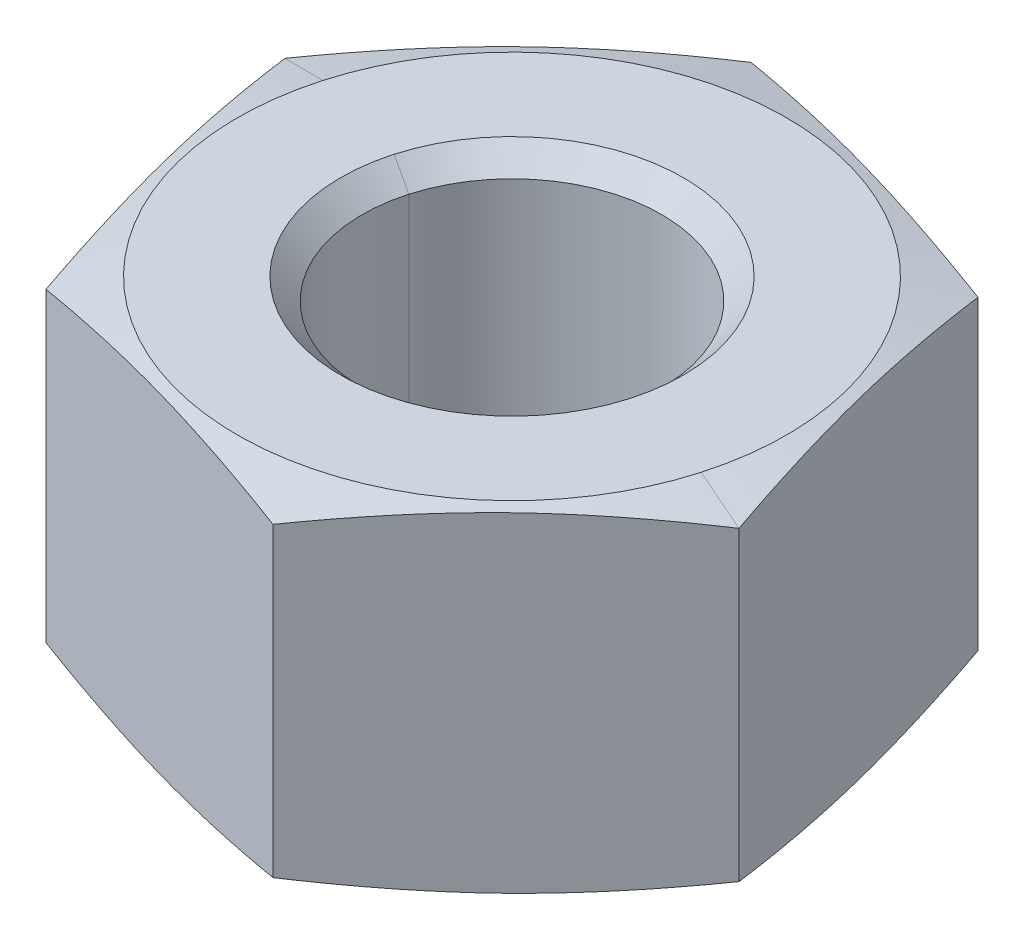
ISO-10303-21;
HEADER;
FILE_DESCRIPTION(('STEP AP214'),'2;1');
FILE_NAME('part.step','',(''),(''),'','','');
FILE_SCHEMA(('AUTOMOTIVE_DESIGN { 1 0 10303 214 1 1 1 1 }'));
ENDSEC;
DATA;
#1=APPLICATION_CONTEXT('core data for automotive mechanical design processes');
#2=APPLICATION_PROTOCOL_DEFINITION('international standard','automotive_design',2000,#1);
#3=PRODUCT_CONTEXT('',#1,'mechanical');
#4=PRODUCT('Part','Part','',(#3));
#5=PRODUCT_RELATED_PRODUCT_CATEGORY('part','',(#4));
#6=PRODUCT_DEFINITION_FORMATION('','',#4);
#7=PRODUCT_DEFINITION_CONTEXT('part definition',#1,'design');
#8=PRODUCT_DEFINITION('design','',#6,#7);
#9=PRODUCT_DEFINITION_SHAPE('','',#8);
#10=(LENGTH_UNIT() NAMED_UNIT(*) SI_UNIT(.MILLI.,.METRE.));
#11=(NAMED_UNIT(*) PLANE_ANGLE_UNIT() SI_UNIT($,.RADIAN.));
#12=(NAMED_UNIT(*) SI_UNIT($,.STERADIAN.) SOLID_ANGLE_UNIT());
#13=UNCERTAINTY_MEASURE_WITH_UNIT(LENGTH_MEASURE(1.E-05),#10,'distance_accuracy_value','');
#14=(GEOMETRIC_REPRESENTATION_CONTEXT(3) GLOBAL_UNCERTAINTY_ASSIGNED_CONTEXT((#13)) GLOBAL_UNIT_ASSIGNED_CONTEXT((#10,
#11,#12)) REPRESENTATION_CONTEXT('',''));
#15=CARTESIAN_POINT('',(0.,0.,0.));
#16=DIRECTION('',(0.,0.,1.));
#17=DIRECTION('',(1.,0.,0.));
#18=AXIS2_PLACEMENT_3D('',#15,#16,#17);
#19=CARTESIAN_POINT('',(-28.,-9.,8.5));
#20=DIRECTION('',(0.,-1.,0.));
#21=DIRECTION('',(-0.961969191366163,0.,-0.273157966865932));
#22=AXIS2_PLACEMENT_3D('',#19,#20,#21);
#23=CONICAL_SURFACE('',#22,2.4,0.785398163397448);
#24=DIRECTION('',(0.680214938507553,-0.707106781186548,0.193151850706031));
#25=VECTOR('',#24,1.);
#26=CARTESIAN_POINT('',(-25.6912739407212,-9.,9.15557912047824));
#27=LINE('',#26,#25);
#28=CARTESIAN_POINT('',(-25.979864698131,-8.7,9.07363173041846));
#29=VERTEX_POINT('',#28);
#30=CARTESIAN_POINT('',(-25.6912739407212,-9.,9.15557912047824));
#31=VERTEX_POINT('',#30);
#32=EDGE_CURVE('E164',#29,#31,#27,.T.);
#33=ORIENTED_EDGE('',*,*,#32,.F.);
#34=CARTESIAN_POINT('',(-28.,-8.7,8.5));
#35=DIRECTION('',(0.,-1.,0.));
#36=DIRECTION('',(-0.961969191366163,0.,-0.273157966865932));
#37=AXIS2_PLACEMENT_3D('',#34,#35,#36);
#38=CIRCLE('',#37,2.1);
#39=CARTESIAN_POINT('',(-30.020135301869,-8.7,7.92636826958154));
#40=VERTEX_POINT('',#39);
#41=EDGE_CURVE('E26',#40,#29,#38,.T.);
#42=ORIENTED_EDGE('',*,*,#41,.F.);
#43=DIRECTION('',(-0.680214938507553,-0.707106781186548,-0.193151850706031));
#44=VECTOR('',#43,1.);
#45=CARTESIAN_POINT('',(-30.3087260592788,-9.,7.84442087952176));
#46=LINE('',#45,#44);
#47=CARTESIAN_POINT('',(-30.3087260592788,-9.,7.84442087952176));
#48=VERTEX_POINT('',#47);
#49=EDGE_CURVE('E172',#40,#48,#46,.T.);
#50=ORIENTED_EDGE('',*,*,#49,.T.);
#51=CARTESIAN_POINT('',(-28.,-9.,8.5));
#52=DIRECTION('',(0.,1.,0.));
#53=DIRECTION('',(-0.961969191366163,0.,-0.273157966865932));
#54=AXIS2_PLACEMENT_3D('',#51,#52,#53);
#55=CIRCLE('',#54,2.4);
#56=EDGE_CURVE('E150',#31,#48,#55,.T.);
#57=ORIENTED_EDGE('',*,*,#56,.F.);
#58=EDGE_LOOP('',(#33,#42,#50,#57));
#59=FACE_BOUND('',#58,.T.);
#60=ADVANCED_FACE('F15',(#59),#23,.F.);
#61=CARTESIAN_POINT('',(-28.,-4.6,8.5));
#62=DIRECTION('',(0.,1.,0.));
#63=DIRECTION('',(0.961969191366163,0.,0.273157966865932));
#64=AXIS2_PLACEMENT_3D('',#61,#62,#63);
#65=CONICAL_SURFACE('',#64,2.1,0.78539816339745);
#66=DIRECTION('',(-0.680214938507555,0.707106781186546,-0.193151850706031));
#67=VECTOR('',#66,1.);
#68=CARTESIAN_POINT('',(-30.020135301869,-4.6,7.92636826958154));
#69=LINE('',#68,#67);
#70=CARTESIAN_POINT('',(-30.020135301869,-4.6,7.92636826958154));
#71=VERTEX_POINT('',#70);
#72=CARTESIAN_POINT('',(-30.3087260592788,-4.3,7.84442087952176));
#73=VERTEX_POINT('',#72);
#74=EDGE_CURVE('E183',#71,#73,#69,.T.);
#75=ORIENTED_EDGE('',*,*,#74,.F.);
#76=CARTESIAN_POINT('',(-28.,-4.6,8.5));
#77=DIRECTION('',(0.,1.,0.));
#78=DIRECTION('',(-0.961969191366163,0.,-0.273157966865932));
#79=AXIS2_PLACEMENT_3D('',#76,#77,#78);
#80=CIRCLE('',#79,2.1);
#81=CARTESIAN_POINT('',(-25.979864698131,-4.6,9.07363173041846));
#82=VERTEX_POINT('',#81);
#83=EDGE_CURVE('E10',#82,#71,#80,.T.);
#84=ORIENTED_EDGE('',*,*,#83,.F.);
#85=DIRECTION('',(0.680214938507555,0.707106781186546,0.193151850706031));
#86=VECTOR('',#85,1.);
#87=CARTESIAN_POINT('',(-25.979864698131,-4.6,9.07363173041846));
#88=LINE('',#87,#86);
#89=CARTESIAN_POINT('',(-25.6912739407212,-4.3,9.15557912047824));
#90=VERTEX_POINT('',#89);
#91=EDGE_CURVE('E192',#82,#90,#88,.T.);
#92=ORIENTED_EDGE('',*,*,#91,.T.);
#93=CARTESIAN_POINT('',(-28.,-4.3,8.5));
#94=DIRECTION('',(0.,-1.,0.));
#95=DIRECTION('',(-0.961969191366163,0.,-0.273157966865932));
#96=AXIS2_PLACEMENT_3D('',#93,#94,#95);
#97=CIRCLE('',#96,2.4);
#98=EDGE_CURVE('E196',#73,#90,#97,.T.);
#99=ORIENTED_EDGE('',*,*,#98,.F.);
#100=EDGE_LOOP('',(#75,#84,#92,#99));
#101=FACE_BOUND('',#100,.T.);
#102=ADVANCED_FACE('F546',(#101),#65,.F.);
#103=CARTESIAN_POINT('',(-28.,-4.3,8.5));
#104=DIRECTION('',(0.,1.,0.));
#105=DIRECTION('',(0.961969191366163,0.,0.273157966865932));
#106=AXIS2_PLACEMENT_3D('',#103,#104,#105);
#107=CYLINDRICAL_SURFACE('',#106,2.1);
#108=DIRECTION('',(0.,1.,0.));
#109=VECTOR('',#108,1.);
#110=CARTESIAN_POINT('',(-30.020135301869,-4.3,7.92636826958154));
#111=LINE('',#110,#109);
#112=EDGE_CURVE('E144',#40,#71,#111,.T.);
#113=ORIENTED_EDGE('',*,*,#112,.F.);
#114=ORIENTED_EDGE('',*,*,#41,.T.);
#115=DIRECTION('',(0.,1.,0.));
#116=VECTOR('',#115,1.);
#117=CARTESIAN_POINT('',(-25.979864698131,-4.3,9.07363173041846));
#118=LINE('',#117,#116);
#119=EDGE_CURVE('E141',#29,#82,#118,.T.);
#120=ORIENTED_EDGE('',*,*,#119,.T.);
#121=ORIENTED_EDGE('',*,*,#83,.T.);
#122=EDGE_LOOP('',(#113,#114,#120,#121));
#123=FACE_BOUND('',#122,.T.);
#124=ADVANCED_FACE('F140',(#123),#107,.F.);
#125=CARTESIAN_POINT('',(-31.3142045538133,-9.,11.7170454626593));
#126=DIRECTION('',(0.,-1.,0.));
#127=DIRECTION('',(-0.961969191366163,0.,-0.273157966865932));
#128=AXIS2_PLACEMENT_3D('',#125,#126,#127);
#129=PLANE('',#128);
#130=CARTESIAN_POINT('',(-28.,-9.,8.5));
#131=DIRECTION('',(0.,1.,0.));
#132=DIRECTION('',(-0.961969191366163,0.,-0.273157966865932));
#133=AXIS2_PLACEMENT_3D('',#130,#131,#132);
#134=CIRCLE('',#133,2.4);
#135=EDGE_CURVE('E169',#48,#31,#134,.T.);
#136=ORIENTED_EDGE('',*,*,#135,.T.);
#137=ORIENTED_EDGE('',*,*,#56,.T.);
#138=EDGE_LOOP('',(#136,#137));
#139=FACE_BOUND('',#138,.T.);
#140=CARTESIAN_POINT('',(-28.,-9.,8.5));
#141=DIRECTION('',(0.,1.,0.));
#142=DIRECTION('',(0.961969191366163,0.,0.273157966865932));
#143=AXIS2_PLACEMENT_3D('',#140,#141,#142);
#144=CIRCLE('',#143,3.85);
#145=CARTESIAN_POINT('',(-24.2964186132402,-9.,9.55165817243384));
#146=VERTEX_POINT('',#145);
#147=CARTESIAN_POINT('',(-31.7035813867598,-9.,7.44834182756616));
#148=VERTEX_POINT('',#147);
#149=EDGE_CURVE('E161',#146,#148,#144,.T.);
#150=ORIENTED_EDGE('',*,*,#149,.F.);
#151=CARTESIAN_POINT('',(-28.,-9.,8.5));
#152=DIRECTION('',(0.,1.,0.));
#153=DIRECTION('',(0.961969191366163,0.,0.273157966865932));
#154=AXIS2_PLACEMENT_3D('',#151,#152,#153);
#155=CIRCLE('',#154,3.85);
#156=EDGE_CURVE('E193',#148,#146,#155,.T.);
#157=ORIENTED_EDGE('',*,*,#156,.F.);
#158=EDGE_LOOP('',(#150,#157));
#159=FACE_BOUND('',#158,.T.);
#160=ADVANCED_FACE('F268',(#139,#159),#129,.T.);
#161=CARTESIAN_POINT('',(-28.,-9.,8.5));
#162=DIRECTION('',(0.,1.,0.));
#163=DIRECTION('',(0.961969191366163,0.,0.273157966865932));
#164=AXIS2_PLACEMENT_3D('',#161,#162,#163);
#165=CONICAL_SURFACE('',#164,3.85,1.30899693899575);
#166=DIRECTION('',(-0.92919088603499,0.258819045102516,-0.263850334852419));
#167=VECTOR('',#166,1.);
#168=CARTESIAN_POINT('',(-31.7035813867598,-9.,7.44834182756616));
#169=LINE('',#168,#167);
#170=CARTESIAN_POINT('',(-32.443145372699,-8.79400008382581,7.2383373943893));
#171=VERTEX_POINT('',#170);
#172=EDGE_CURVE('E205',#148,#171,#169,.T.);
#173=ORIENTED_EDGE('',*,*,#172,.F.);
#174=ORIENTED_EDGE('',*,*,#156,.T.);
#175=DIRECTION('',(0.92919088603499,0.258819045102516,0.263850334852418));
#176=VECTOR('',#175,1.);
#177=CARTESIAN_POINT('',(-24.2964186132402,-9.,9.55165817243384));
#178=LINE('',#177,#176);
#179=CARTESIAN_POINT('',(-23.556854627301,-8.79400008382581,9.7616626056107));
#180=VERTEX_POINT('',#179);
#181=EDGE_CURVE('E211',#146,#180,#178,.T.);
#182=ORIENTED_EDGE('',*,*,#181,.T.);
#183=CARTESIAN_POINT('',(-26.8710591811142,-8.79400008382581,12.97870806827));
#184=CARTESIAN_POINT('',(-25.9832386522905,-8.95976693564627,12.1169148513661));
#185=CARTESIAN_POINT('',(-25.2139569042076,-8.95980762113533,11.3701853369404));
#186=CARTESIAN_POINT('',(-24.4451108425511,-8.95984828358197,10.6238787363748));
#187=CARTESIAN_POINT('',(-23.556854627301,-8.79400008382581,9.7616626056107));
#188=B_SPLINE_CURVE_WITH_KNOTS('',2,(#183,#184,#185,#186,#187),.UNSPECIFIED.,.F.,.F.,(3,2,3),
(0.,0.5,1.),.UNSPECIFIED.);
#189=CARTESIAN_POINT('',(-26.8710591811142,-8.79400008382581,12.97870806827));
#190=VERTEX_POINT('',#189);
#191=EDGE_CURVE('E49',#190,#180,#188,.T.);
#192=ORIENTED_EDGE('',*,*,#191,.F.);
#193=CARTESIAN_POINT('',(-31.3142045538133,-8.79400008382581,11.7170454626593));
#194=CARTESIAN_POINT('',(-30.1260333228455,-8.95947810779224,12.0544351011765));
#195=CARTESIAN_POINT('',(-29.0965242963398,-8.9598070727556,12.3467714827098));
#196=CARTESIAN_POINT('',(-28.0639615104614,-8.96013701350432,12.6399750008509));
#197=CARTESIAN_POINT('',(-26.8710591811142,-8.79400008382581,12.97870806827));
#198=B_SPLINE_CURVE_WITH_KNOTS('',2,(#193,#194,#195,#196,#197),.UNSPECIFIED.,.F.,.F.,(3,2,3),
(0.,0.5,1.),.UNSPECIFIED.);
#199=CARTESIAN_POINT('',(-31.3142045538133,-8.79400008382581,11.7170454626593));
#200=VERTEX_POINT('',#199);
#201=EDGE_CURVE('E326',#200,#190,#198,.T.);
#202=ORIENTED_EDGE('',*,*,#201,.F.);
#203=CARTESIAN_POINT('',(-32.443145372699,-8.79400008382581,7.2383373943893));
#204=CARTESIAN_POINT('',(-32.140720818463,-8.95976693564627,8.43810913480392));
#205=CARTESIAN_POINT('',(-31.8786749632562,-8.95980762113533,9.4776914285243));
#206=CARTESIAN_POINT('',(-31.6167775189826,-8.95984828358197,10.5166849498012));
#207=CARTESIAN_POINT('',(-31.3142045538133,-8.79400008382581,11.7170454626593));
#208=B_SPLINE_CURVE_WITH_KNOTS('',2,(#203,#204,#205,#206,#207),.UNSPECIFIED.,.F.,.F.,(3,2,3),
(0.,0.5,1.),.UNSPECIFIED.);
#209=EDGE_CURVE('E511',#171,#200,#208,.T.);
#210=ORIENTED_EDGE('',*,*,#209,.F.);
#211=EDGE_LOOP('',(#173,#174,#182,#192,#202,#210));
#212=FACE_BOUND('',#211,.T.);
#213=ADVANCED_FACE('F257',(#212),#165,.T.);
#214=CARTESIAN_POINT('',(-31.3142045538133,-4.3,11.7170454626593));
#215=DIRECTION('',(0.,-1.,0.));
#216=DIRECTION('',(-0.961969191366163,0.,-0.273157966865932));
#217=AXIS2_PLACEMENT_3D('',#214,#215,#216);
#218=PLANE('',#217);
#219=CARTESIAN_POINT('',(-28.,-4.3,8.5));
#220=DIRECTION('',(0.,-1.,0.));
#221=DIRECTION('',(-0.961969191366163,0.,-0.273157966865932));
#222=AXIS2_PLACEMENT_3D('',#219,#220,#221);
#223=CIRCLE('',#222,2.4);
#224=EDGE_CURVE('E188',#90,#73,#223,.T.);
#225=ORIENTED_EDGE('',*,*,#224,.T.);
#226=ORIENTED_EDGE('',*,*,#98,.T.);
#227=EDGE_LOOP('',(#225,#226));
#228=FACE_BOUND('',#227,.T.);
#229=CARTESIAN_POINT('',(-28.,-4.3,8.5));
#230=DIRECTION('',(0.,1.,0.));
#231=DIRECTION('',(0.961969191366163,0.,0.273157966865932));
#232=AXIS2_PLACEMENT_3D('',#229,#230,#231);
#233=CIRCLE('',#232,3.85);
#234=CARTESIAN_POINT('',(-31.7035813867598,-4.3,7.44834182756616));
#235=VERTEX_POINT('',#234);
#236=CARTESIAN_POINT('',(-24.2964186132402,-4.3,9.55165817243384));
#237=VERTEX_POINT('',#236);
#238=EDGE_CURVE('E212',#235,#237,#233,.T.);
#239=ORIENTED_EDGE('',*,*,#238,.T.);
#240=CARTESIAN_POINT('',(-28.,-4.3,8.5));
#241=DIRECTION('',(0.,1.,0.));
#242=DIRECTION('',(0.961969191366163,0.,0.273157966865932));
#243=AXIS2_PLACEMENT_3D('',#240,#241,#242);
#244=CIRCLE('',#243,3.85);
#245=EDGE_CURVE('E206',#237,#235,#244,.T.);
#246=ORIENTED_EDGE('',*,*,#245,.T.);
#247=EDGE_LOOP('',(#239,#246));
#248=FACE_BOUND('',#247,.T.);
#249=ADVANCED_FACE('F267',(#228,#248),#218,.F.);
#250=CARTESIAN_POINT('',(-28.,-4.50599991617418,8.5));
#251=DIRECTION('',(0.,-1.,0.));
#252=DIRECTION('',(-0.961969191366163,0.,-0.273157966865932));
#253=AXIS2_PLACEMENT_3D('',#250,#251,#252);
#254=CONICAL_SURFACE('',#253,4.61880215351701,1.30899693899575);
#255=DIRECTION('',(0.92919088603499,-0.258819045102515,0.263850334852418));
#256=VECTOR('',#255,1.);
#257=CARTESIAN_POINT('',(-23.556854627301,-4.50599991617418,9.7616626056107));
#258=LINE('',#257,#256);
#259=CARTESIAN_POINT('',(-23.556854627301,-4.50599991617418,9.7616626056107));
#260=VERTEX_POINT('',#259);
#261=EDGE_CURVE('E210',#237,#260,#258,.T.);
#262=ORIENTED_EDGE('',*,*,#261,.F.);
#263=ORIENTED_EDGE('',*,*,#238,.F.);
#264=DIRECTION('',(-0.92919088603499,-0.258819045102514,-0.263850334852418));
#265=VECTOR('',#264,1.);
#266=CARTESIAN_POINT('',(-32.443145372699,-4.50599991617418,7.2383373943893));
#267=LINE('',#266,#265);
#268=CARTESIAN_POINT('',(-32.443145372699,-4.50599991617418,7.2383373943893));
#269=VERTEX_POINT('',#268);
#270=EDGE_CURVE('E495',#235,#269,#267,.T.);
#271=ORIENTED_EDGE('',*,*,#270,.T.);
#272=CARTESIAN_POINT('',(-31.3142045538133,-4.50599991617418,11.7170454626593));
#273=CARTESIAN_POINT('',(-31.6166291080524,-4.340233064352,10.5172737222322));
#274=CARTESIAN_POINT('',(-31.8786749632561,-4.34019237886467,9.4776914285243));
#275=CARTESIAN_POINT('',(-32.1405724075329,-4.34015171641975,8.4386979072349));
#276=CARTESIAN_POINT('',(-32.443145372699,-4.50599991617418,7.2383373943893));
#277=B_SPLINE_CURVE_WITH_KNOTS('',2,(#272,#273,#274,#275,#276),.UNSPECIFIED.,.F.,.F.,(3,2,3),
(0.,0.5,1.),.UNSPECIFIED.);
#278=CARTESIAN_POINT('',(-31.3142045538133,-4.50599991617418,11.7170454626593));
#279=VERTEX_POINT('',#278);
#280=EDGE_CURVE('E525',#279,#269,#277,.T.);
#281=ORIENTED_EDGE('',*,*,#280,.F.);
#282=CARTESIAN_POINT('',(-26.8710591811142,-4.50599991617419,12.97870806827));
#283=CARTESIAN_POINT('',(-28.0634107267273,-4.33993969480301,12.6401313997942));
#284=CARTESIAN_POINT('',(-29.0965242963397,-4.34019292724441,12.3467714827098));
#285=CARTESIAN_POINT('',(-30.1254822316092,-4.34044514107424,12.0545915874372));
#286=CARTESIAN_POINT('',(-31.3142045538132,-4.50599991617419,11.7170454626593));
#287=B_SPLINE_CURVE_WITH_KNOTS('',2,(#282,#283,#284,#285,#286),.UNSPECIFIED.,.F.,.F.,(3,2,3),
(0.,0.5,1.),.UNSPECIFIED.);
#288=CARTESIAN_POINT('',(-26.8710591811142,-4.50599991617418,12.97870806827));
#289=VERTEX_POINT('',#288);
#290=EDGE_CURVE('E295',#289,#279,#287,.T.);
#291=ORIENTED_EDGE('',*,*,#290,.F.);
#292=CARTESIAN_POINT('',(-23.556854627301,-4.50599991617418,9.7616626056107));
#293=CARTESIAN_POINT('',(-24.4446751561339,-4.340233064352,10.6234558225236));
#294=CARTESIAN_POINT('',(-25.2139569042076,-4.34019237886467,11.3701853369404));
#295=CARTESIAN_POINT('',(-25.9828029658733,-4.34015171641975,12.1164919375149));
#296=CARTESIAN_POINT('',(-26.8710591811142,-4.50599991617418,12.97870806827));
#297=B_SPLINE_CURVE_WITH_KNOTS('',2,(#292,#293,#294,#295,#296),.UNSPECIFIED.,.F.,.F.,(3,2,3),
(0.,0.5,1.),.UNSPECIFIED.);
#298=EDGE_CURVE('E38',#260,#289,#297,.T.);
#299=ORIENTED_EDGE('',*,*,#298,.F.);
#300=EDGE_LOOP('',(#262,#263,#271,#281,#291,#299));
#301=FACE_BOUND('',#300,.T.);
#302=ADVANCED_FACE('F234',(#301),#254,.T.);
#303=CARTESIAN_POINT('',(-23.556854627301,-9.,9.7616626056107));
#304=DIRECTION('',(-0.696510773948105,0.,-0.717546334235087));
#305=DIRECTION('',(0.,1.,0.));
#306=AXIS2_PLACEMENT_3D('',#303,#304,#305);
#307=PLANE('',#306);
#308=DIRECTION('',(0.,1.,0.));
#309=VECTOR('',#308,1.);
#310=CARTESIAN_POINT('',(-26.8710591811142,-9.,12.97870806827));
#311=LINE('',#310,#309);
#312=EDGE_CURVE('E485',#190,#289,#311,.T.);
#313=ORIENTED_EDGE('',*,*,#312,.F.);
#314=ORIENTED_EDGE('',*,*,#191,.T.);
#315=DIRECTION('',(0.,1.,0.));
#316=VECTOR('',#315,1.);
#317=CARTESIAN_POINT('',(-23.556854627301,-9.,9.7616626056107));
#318=LINE('',#317,#316);
#319=EDGE_CURVE('E447',#180,#260,#318,.T.);
#320=ORIENTED_EDGE('',*,*,#319,.T.);
#321=ORIENTED_EDGE('',*,*,#298,.T.);
#322=EDGE_LOOP('',(#313,#314,#320,#321));
#323=FACE_BOUND('',#322,.T.);
#324=ADVANCED_FACE('F224',(#323),#307,.F.);
#325=CARTESIAN_POINT('',(-24.6857954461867,-9.,5.28295453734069));
#326=DIRECTION('',(-0.969668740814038,0.,0.244422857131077));
#327=DIRECTION('',(0.,1.,0.));
#328=AXIS2_PLACEMENT_3D('',#325,#326,#327);
#329=PLANE('',#328);
#330=ORIENTED_EDGE('',*,*,#319,.F.);
#331=CARTESIAN_POINT('',(-23.556854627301,-8.79400008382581,9.7616626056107));
#332=CARTESIAN_POINT('',(-23.8592791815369,-8.95976693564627,8.56189086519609));
#333=CARTESIAN_POINT('',(-24.1213250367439,-8.95980762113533,7.52230857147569));
#334=CARTESIAN_POINT('',(-24.3832224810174,-8.95984828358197,6.48331505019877));
#335=CARTESIAN_POINT('',(-24.6857954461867,-8.79400008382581,5.28295453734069));
#336=B_SPLINE_CURVE_WITH_KNOTS('',2,(#331,#332,#333,#334,#335),.UNSPECIFIED.,.F.,.F.,(3,2,3),
(0.,0.5,1.),.UNSPECIFIED.);
#337=CARTESIAN_POINT('',(-24.6857954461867,-8.79400008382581,5.28295453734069));
#338=VERTEX_POINT('',#337);
#339=EDGE_CURVE('E380',#180,#338,#336,.T.);
#340=ORIENTED_EDGE('',*,*,#339,.T.);
#341=DIRECTION('',(0.,1.,0.));
#342=VECTOR('',#341,1.);
#343=CARTESIAN_POINT('',(-24.6857954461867,-9.,5.28295453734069));
#344=LINE('',#343,#342);
#345=CARTESIAN_POINT('',(-24.6857954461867,-4.50599991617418,5.28295453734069));
#346=VERTEX_POINT('',#345);
#347=EDGE_CURVE('E439',#338,#346,#344,.T.);
#348=ORIENTED_EDGE('',*,*,#347,.T.);
#349=CARTESIAN_POINT('',(-24.6857954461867,-4.50599991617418,5.28295453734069));
#350=CARTESIAN_POINT('',(-24.3833708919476,-4.340233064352,6.48272627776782));
#351=CARTESIAN_POINT('',(-24.1213250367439,-4.34019237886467,7.52230857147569));
#352=CARTESIAN_POINT('',(-23.8594275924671,-4.34015171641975,8.56130209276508));
#353=CARTESIAN_POINT('',(-23.556854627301,-4.50599991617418,9.7616626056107));
#354=B_SPLINE_CURVE_WITH_KNOTS('',2,(#349,#350,#351,#352,#353),.UNSPECIFIED.,.F.,.F.,(3,2,3),
(0.,0.5,1.),.UNSPECIFIED.);
#355=EDGE_CURVE('E453',#346,#260,#354,.T.);
#356=ORIENTED_EDGE('',*,*,#355,.T.);
#357=EDGE_LOOP('',(#330,#340,#348,#356));
#358=FACE_BOUND('',#357,.T.);
#359=ADVANCED_FACE('F233',(#358),#329,.F.);
#360=CARTESIAN_POINT('',(-29.1289408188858,-9.,4.02129193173));
#361=DIRECTION('',(-0.273157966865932,0.,0.961969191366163));
#362=DIRECTION('',(0.,1.,0.));
#363=AXIS2_PLACEMENT_3D('',#360,#361,#362);
#364=PLANE('',#363);
#365=ORIENTED_EDGE('',*,*,#347,.F.);
#366=CARTESIAN_POINT('',(-24.6857954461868,-8.79400008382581,5.28295453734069));
#367=CARTESIAN_POINT('',(-25.8781469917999,-8.96006030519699,4.94437786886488));
#368=CARTESIAN_POINT('',(-26.9112605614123,-8.95980707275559,4.65101795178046));
#369=CARTESIAN_POINT('',(-27.9402184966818,-8.95955485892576,4.35883805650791));
#370=CARTESIAN_POINT('',(-29.1289408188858,-8.79400008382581,4.02129193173));
#371=B_SPLINE_CURVE_WITH_KNOTS('',2,(#366,#367,#368,#369,#370),.UNSPECIFIED.,.F.,.F.,(3,2,3),
(0.,0.5,1.),.UNSPECIFIED.);
#372=CARTESIAN_POINT('',(-29.1289408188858,-8.79400008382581,4.02129193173));
#373=VERTEX_POINT('',#372);
#374=EDGE_CURVE('E375',#338,#373,#371,.T.);
#375=ORIENTED_EDGE('',*,*,#374,.T.);
#376=DIRECTION('',(0.,1.,0.));
#377=VECTOR('',#376,1.);
#378=CARTESIAN_POINT('',(-29.1289408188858,-9.,4.02129193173));
#379=LINE('',#378,#377);
#380=CARTESIAN_POINT('',(-29.1289408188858,-4.50599991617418,4.02129193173));
#381=VERTEX_POINT('',#380);
#382=EDGE_CURVE('E448',#373,#381,#379,.T.);
#383=ORIENTED_EDGE('',*,*,#382,.T.);
#384=CARTESIAN_POINT('',(-29.1289408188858,-4.50599991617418,4.02129193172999));
#385=CARTESIAN_POINT('',(-27.9407695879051,-4.34052189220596,4.35868157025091));
#386=CARTESIAN_POINT('',(-26.9112605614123,-4.34019292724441,4.65101795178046));
#387=CARTESIAN_POINT('',(-25.878697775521,-4.33986298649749,4.94422146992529));
#388=CARTESIAN_POINT('',(-24.6857954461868,-4.50599991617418,5.28295453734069));
#389=B_SPLINE_CURVE_WITH_KNOTS('',2,(#384,#385,#386,#387,#388),.UNSPECIFIED.,.F.,.F.,(3,2,3),
(0.,0.5,1.),.UNSPECIFIED.);
#390=EDGE_CURVE('E435',#381,#346,#389,.T.);
#391=ORIENTED_EDGE('',*,*,#390,.T.);
#392=EDGE_LOOP('',(#365,#375,#383,#391));
#393=FACE_BOUND('',#392,.T.);
#394=ADVANCED_FACE('F355',(#393),#364,.F.);
#395=CARTESIAN_POINT('',(-32.443145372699,-9.,7.2383373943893));
#396=DIRECTION('',(0.696510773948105,0.,0.717546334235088));
#397=DIRECTION('',(0.717546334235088,0.,-0.696510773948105));
#398=AXIS2_PLACEMENT_3D('',#395,#396,#397);
#399=PLANE('',#398);
#400=ORIENTED_EDGE('',*,*,#382,.F.);
#401=CARTESIAN_POINT('',(-29.1289408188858,-8.79400008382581,4.02129193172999));
#402=CARTESIAN_POINT('',(-30.0167613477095,-8.95976693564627,4.88308514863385));
#403=CARTESIAN_POINT('',(-30.7860430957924,-8.95980762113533,5.62981466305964));
#404=CARTESIAN_POINT('',(-31.5548891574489,-8.95984828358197,6.37612126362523));
#405=CARTESIAN_POINT('',(-32.443145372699,-8.79400008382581,7.2383373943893));
#406=B_SPLINE_CURVE_WITH_KNOTS('',2,(#401,#402,#403,#404,#405),.UNSPECIFIED.,.F.,.F.,(3,2,3),
(0.,0.5,1.),.UNSPECIFIED.);
#407=EDGE_CURVE('E287',#373,#171,#406,.T.);
#408=ORIENTED_EDGE('',*,*,#407,.T.);
#409=DIRECTION('',(0.,1.,0.));
#410=VECTOR('',#409,1.);
#411=CARTESIAN_POINT('',(-32.443145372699,-9.,7.2383373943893));
#412=LINE('',#411,#410);
#413=EDGE_CURVE('E491',#171,#269,#412,.T.);
#414=ORIENTED_EDGE('',*,*,#413,.T.);
#415=CARTESIAN_POINT('',(-32.443145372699,-4.50599991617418,7.2383373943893));
#416=CARTESIAN_POINT('',(-31.5553248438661,-4.340233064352,6.37654417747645));
#417=CARTESIAN_POINT('',(-30.7860430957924,-4.34019237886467,5.62981466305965));
#418=CARTESIAN_POINT('',(-30.0171970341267,-4.34015171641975,4.88350806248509));
#419=CARTESIAN_POINT('',(-29.1289408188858,-4.50599991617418,4.02129193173));
#420=B_SPLINE_CURVE_WITH_KNOTS('',2,(#415,#416,#417,#418,#419),.UNSPECIFIED.,.F.,.F.,(3,2,3),
(0.,0.5,1.),.UNSPECIFIED.);
#421=EDGE_CURVE('E340',#269,#381,#420,.T.);
#422=ORIENTED_EDGE('',*,*,#421,.T.);
#423=EDGE_LOOP('',(#400,#408,#414,#422));
#424=FACE_BOUND('',#423,.T.);
#425=ADVANCED_FACE('F347',(#424),#399,.F.);
#426=CARTESIAN_POINT('',(-31.3142045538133,-9.,11.7170454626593));
#427=DIRECTION('',(0.969668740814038,0.,-0.244422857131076));
#428=DIRECTION('',(0.,-1.,0.));
#429=AXIS2_PLACEMENT_3D('',#426,#427,#428);
#430=PLANE('',#429);
#431=ORIENTED_EDGE('',*,*,#413,.F.);
#432=ORIENTED_EDGE('',*,*,#209,.T.);
#433=DIRECTION('',(0.,1.,0.));
#434=VECTOR('',#433,1.);
#435=CARTESIAN_POINT('',(-31.3142045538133,-9.,11.7170454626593));
#436=LINE('',#435,#434);
#437=EDGE_CURVE('E492',#200,#279,#436,.T.);
#438=ORIENTED_EDGE('',*,*,#437,.T.);
#439=ORIENTED_EDGE('',*,*,#280,.T.);
#440=EDGE_LOOP('',(#431,#432,#438,#439));
#441=FACE_BOUND('',#440,.T.);
#442=ADVANCED_FACE('F312',(#441),#430,.F.);
#443=CARTESIAN_POINT('',(-26.8710591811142,-9.,12.97870806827));
#444=DIRECTION('',(0.273157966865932,0.,-0.961969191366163));
#445=DIRECTION('',(-0.961969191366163,0.,-0.273157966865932));
#446=AXIS2_PLACEMENT_3D('',#443,#444,#445);
#447=PLANE('',#446);
#448=ORIENTED_EDGE('',*,*,#437,.F.);
#449=ORIENTED_EDGE('',*,*,#201,.T.);
#450=ORIENTED_EDGE('',*,*,#312,.T.);
#451=ORIENTED_EDGE('',*,*,#290,.T.);
#452=EDGE_LOOP('',(#448,#449,#450,#451));
#453=FACE_BOUND('',#452,.T.);
#454=ADVANCED_FACE('F302',(#453),#447,.F.);
#455=CARTESIAN_POINT('',(-28.,-4.50599991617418,8.5));
#456=DIRECTION('',(0.,-1.,0.));
#457=DIRECTION('',(-0.961969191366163,0.,-0.273157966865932));
#458=AXIS2_PLACEMENT_3D('',#455,#456,#457);
#459=CONICAL_SURFACE('',#458,4.61880215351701,1.30899693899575);
#460=ORIENTED_EDGE('',*,*,#245,.F.);
#461=ORIENTED_EDGE('',*,*,#261,.T.);
#462=ORIENTED_EDGE('',*,*,#355,.F.);
#463=ORIENTED_EDGE('',*,*,#390,.F.);
#464=ORIENTED_EDGE('',*,*,#421,.F.);
#465=ORIENTED_EDGE('',*,*,#270,.F.);
#466=EDGE_LOOP('',(#460,#461,#462,#463,#464,#465));
#467=FACE_BOUND('',#466,.T.);
#468=ADVANCED_FACE('F311',(#467),#459,.T.);
#469=CARTESIAN_POINT('',(-28.,-9.,8.5));
#470=DIRECTION('',(0.,1.,0.));
#471=DIRECTION('',(0.961969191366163,0.,0.273157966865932));
#472=AXIS2_PLACEMENT_3D('',#469,#470,#471);
#473=CONICAL_SURFACE('',#472,3.85,1.30899693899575);
#474=ORIENTED_EDGE('',*,*,#149,.T.);
#475=ORIENTED_EDGE('',*,*,#172,.T.);
#476=ORIENTED_EDGE('',*,*,#407,.F.);
#477=ORIENTED_EDGE('',*,*,#374,.F.);
#478=ORIENTED_EDGE('',*,*,#339,.F.);
#479=ORIENTED_EDGE('',*,*,#181,.F.);
#480=EDGE_LOOP('',(#474,#475,#476,#477,#478,#479));
#481=FACE_BOUND('',#480,.T.);
#482=ADVANCED_FACE('F237',(#481),#473,.T.);
#483=CARTESIAN_POINT('',(-28.,-4.3,8.5));
#484=DIRECTION('',(0.,1.,0.));
#485=DIRECTION('',(0.961969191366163,0.,0.273157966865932));
#486=AXIS2_PLACEMENT_3D('',#483,#484,#485);
#487=CYLINDRICAL_SURFACE('',#486,2.1);
#488=CARTESIAN_POINT('',(-28.,-8.7,8.5));
#489=DIRECTION('',(0.,-1.,0.));
#490=DIRECTION('',(-0.961969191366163,0.,-0.273157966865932));
#491=AXIS2_PLACEMENT_3D('',#488,#489,#490);
#492=CIRCLE('',#491,2.1);
#493=EDGE_CURVE('E157',#29,#40,#492,.T.);
#494=ORIENTED_EDGE('',*,*,#493,.T.);
#495=ORIENTED_EDGE('',*,*,#112,.T.);
#496=CARTESIAN_POINT('',(-28.,-4.6,8.5));
#497=DIRECTION('',(0.,1.,0.));
#498=DIRECTION('',(-0.961969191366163,0.,-0.273157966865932));
#499=AXIS2_PLACEMENT_3D('',#496,#497,#498);
#500=CIRCLE('',#499,2.1);
#501=EDGE_CURVE('E159',#71,#82,#500,.T.);
#502=ORIENTED_EDGE('',*,*,#501,.T.);
#503=ORIENTED_EDGE('',*,*,#119,.F.);
#504=EDGE_LOOP('',(#494,#495,#502,#503));
#505=FACE_BOUND('',#504,.T.);
#506=ADVANCED_FACE('F155',(#505),#487,.F.);
#507=CARTESIAN_POINT('',(-28.,-4.6,8.5));
#508=DIRECTION('',(0.,1.,0.));
#509=DIRECTION('',(0.961969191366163,0.,0.273157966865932));
#510=AXIS2_PLACEMENT_3D('',#507,#508,#509);
#511=CONICAL_SURFACE('',#510,2.1,0.78539816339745);
#512=ORIENTED_EDGE('',*,*,#501,.F.);
#513=ORIENTED_EDGE('',*,*,#74,.T.);
#514=ORIENTED_EDGE('',*,*,#224,.F.);
#515=ORIENTED_EDGE('',*,*,#91,.F.);
#516=EDGE_LOOP('',(#512,#513,#514,#515));
#517=FACE_BOUND('',#516,.T.);
#518=ADVANCED_FACE('F557',(#517),#511,.F.);
#519=CARTESIAN_POINT('',(-28.,-9.,8.5));
#520=DIRECTION('',(0.,-1.,0.));
#521=DIRECTION('',(-0.961969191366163,0.,-0.273157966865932));
#522=AXIS2_PLACEMENT_3D('',#519,#520,#521);
#523=CONICAL_SURFACE('',#522,2.4,0.785398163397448);
#524=ORIENTED_EDGE('',*,*,#493,.F.);
#525=ORIENTED_EDGE('',*,*,#32,.T.);
#526=ORIENTED_EDGE('',*,*,#135,.F.);
#527=ORIENTED_EDGE('',*,*,#49,.F.);
#528=EDGE_LOOP('',(#524,#525,#526,#527));
#529=FACE_BOUND('',#528,.T.);
#530=ADVANCED_FACE('F171',(#529),#523,.F.);
#531=CLOSED_SHELL('',(#60,#102,#124,#160,#213,#249,#302,#324,#359,#394,#425,#442,#454,#468,#482,
#506,#518,#530));
#532=MANIFOLD_SOLID_BREP('B1',#531);
#533=ADVANCED_BREP_SHAPE_REPRESENTATION('',(#18,#532),#14);
#534=SHAPE_DEFINITION_REPRESENTATION(#9,#533);
ENDSEC;
END-ISO-10303-21;
